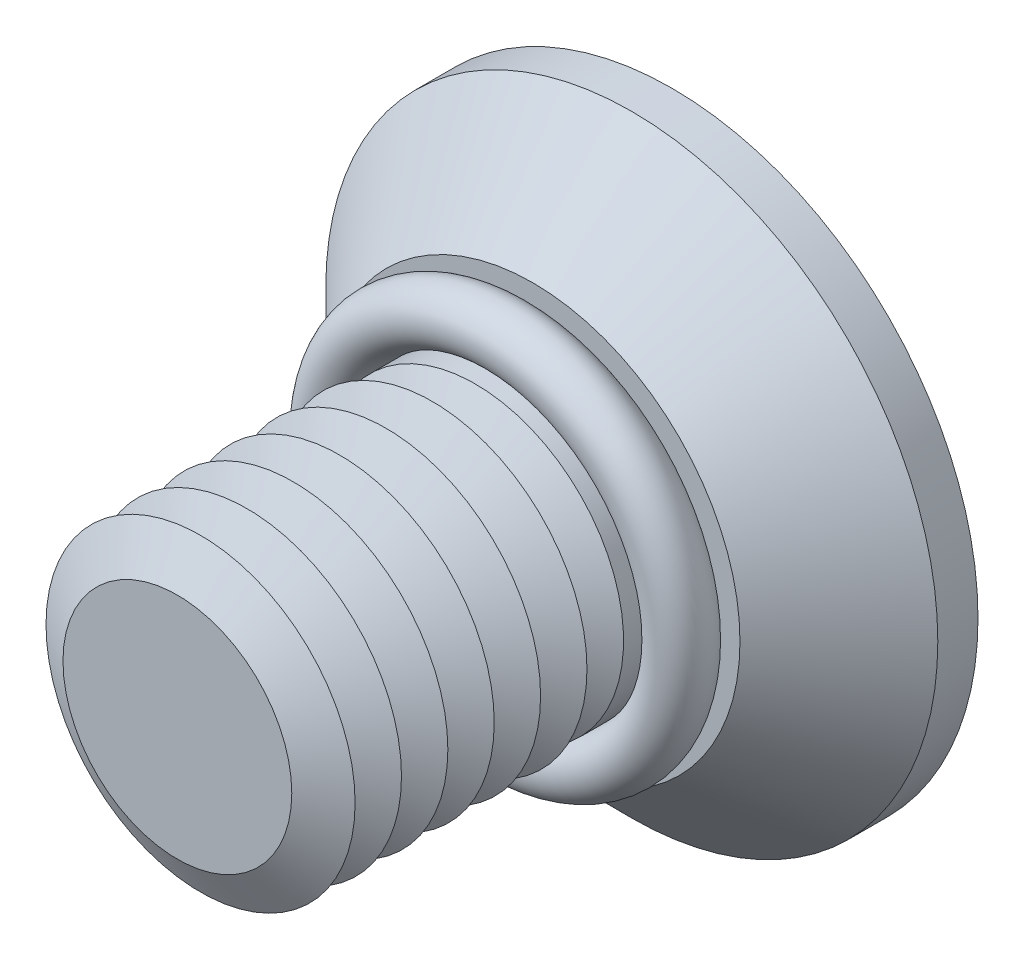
ISO-10303-21;
HEADER;
FILE_DESCRIPTION(('STEP AP214'),'2;1');
FILE_NAME('part.step','',(''),(''),'','','');
FILE_SCHEMA(('AUTOMOTIVE_DESIGN { 1 0 10303 214 1 1 1 1 }'));
ENDSEC;
DATA;
#1=APPLICATION_CONTEXT('core data for automotive mechanical design processes');
#2=APPLICATION_PROTOCOL_DEFINITION('international standard','automotive_design',2000,#1);
#3=PRODUCT_CONTEXT('',#1,'mechanical');
#4=PRODUCT('Part','Part','',(#3));
#5=PRODUCT_RELATED_PRODUCT_CATEGORY('part','',(#4));
#6=PRODUCT_DEFINITION_FORMATION('','',#4);
#7=PRODUCT_DEFINITION_CONTEXT('part definition',#1,'design');
#8=PRODUCT_DEFINITION('design','',#6,#7);
#9=PRODUCT_DEFINITION_SHAPE('','',#8);
#10=(LENGTH_UNIT() NAMED_UNIT(*) SI_UNIT(.MILLI.,.METRE.));
#11=(NAMED_UNIT(*) PLANE_ANGLE_UNIT() SI_UNIT($,.RADIAN.));
#12=(NAMED_UNIT(*) SI_UNIT($,.STERADIAN.) SOLID_ANGLE_UNIT());
#13=UNCERTAINTY_MEASURE_WITH_UNIT(LENGTH_MEASURE(1.E-05),#10,'distance_accuracy_value','');
#14=(GEOMETRIC_REPRESENTATION_CONTEXT(3) GLOBAL_UNCERTAINTY_ASSIGNED_CONTEXT((#13)) GLOBAL_UNIT_ASSIGNED_CONTEXT((#10,
#11,#12)) REPRESENTATION_CONTEXT('',''));
#15=CARTESIAN_POINT('',(0.,0.,0.));
#16=DIRECTION('',(0.,0.,1.));
#17=DIRECTION('',(1.,0.,0.));
#18=AXIS2_PLACEMENT_3D('',#15,#16,#17);
#19=CARTESIAN_POINT('',(0.,0.,5.39999999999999));
#20=DIRECTION('',(0.,0.,1.));
#21=DIRECTION('',(1.,0.,0.));
#22=AXIS2_PLACEMENT_3D('',#19,#20,#21);
#23=TOROIDAL_SURFACE('',#22,5.7,0.9);
#24=CARTESIAN_POINT('',(0.,5.7,5.39999999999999));
#25=DIRECTION('',(1.,0.,0.));
#26=DIRECTION('',(0.,0.,-1.));
#27=AXIS2_PLACEMENT_3D('',#24,#25,#26);
#28=CIRCLE('',#27,0.9);
#29=CARTESIAN_POINT('',(0.,6.6,5.39999999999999));
#30=VERTEX_POINT('',#29);
#31=EDGE_CURVE('P0_E10',#30,#30,#28,.T.);
#32=CARTESIAN_POINT('',(0.,0.,5.39999999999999));
#33=DIRECTION('',(0.,0.,1.));
#34=DIRECTION('',(1.,0.,0.));
#35=AXIS2_PLACEMENT_3D('',#32,#33,#34);
#36=CIRCLE('',#35,6.6);
#37=EDGE_CURVE('',#30,#30,#36,.T.);
#38=ORIENTED_EDGE('',*,*,#31,.F.);
#39=ORIENTED_EDGE('',*,*,#31,.T.);
#40=ORIENTED_EDGE('',*,*,#37,.T.);
#41=ORIENTED_EDGE('',*,*,#37,.F.);
#42=EDGE_LOOP('',(#38,#40,#39,#41));
#43=FACE_BOUND('',#42,.T.);
#44=ADVANCED_FACE('P0_F14',(#43),#23,.T.);
#45=CLOSED_SHELL('',(#44));
#46=MANIFOLD_SOLID_BREP('P0_B1',#45);
#47=CARTESIAN_POINT('',(0.,0.,8.5));
#48=DIRECTION('',(0.,0.,-1.));
#49=DIRECTION('',(-1.,0.,0.));
#50=AXIS2_PLACEMENT_3D('',#47,#48,#49);
#51=CONICAL_SURFACE('',#50,3.70096189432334,1.0471975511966);
#52=CARTESIAN_POINT('',(0.,0.,7.75));
#53=DIRECTION('',(0.,0.,1.));
#54=DIRECTION('',(1.,0.,0.));
#55=AXIS2_PLACEMENT_3D('',#52,#53,#54);
#56=CIRCLE('',#55,5.);
#57=CARTESIAN_POINT('',(5.,0.,7.75));
#58=VERTEX_POINT('',#57);
#59=EDGE_CURVE('P1_E324',#58,#58,#56,.T.);
#60=ORIENTED_EDGE('',*,*,#59,.T.);
#61=EDGE_LOOP('',(#60));
#62=FACE_BOUND('',#61,.T.);
#63=CARTESIAN_POINT('',(0.,0.,8.5));
#64=DIRECTION('',(0.,0.,1.));
#65=DIRECTION('',(1.,0.,0.));
#66=AXIS2_PLACEMENT_3D('',#63,#64,#65);
#67=CIRCLE('',#66,3.70096189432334);
#68=CARTESIAN_POINT('',(3.70096189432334,0.,8.5));
#69=VERTEX_POINT('',#68);
#70=EDGE_CURVE('P1_E321',#69,#69,#67,.T.);
#71=ORIENTED_EDGE('',*,*,#70,.F.);
#72=EDGE_LOOP('',(#71));
#73=FACE_BOUND('',#72,.T.);
#74=ADVANCED_FACE('P1_F15',(#62,#73),#51,.T.);
#75=CARTESIAN_POINT('',(0.,0.,9.25));
#76=DIRECTION('',(0.,0.,1.));
#77=DIRECTION('',(1.,0.,0.));
#78=AXIS2_PLACEMENT_3D('',#75,#76,#77);
#79=CONICAL_SURFACE('',#78,5.,1.0471975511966);
#80=ORIENTED_EDGE('',*,*,#70,.T.);
#81=EDGE_LOOP('',(#80));
#82=FACE_BOUND('',#81,.T.);
#83=CARTESIAN_POINT('',(0.,0.,9.25));
#84=DIRECTION('',(0.,0.,1.));
#85=DIRECTION('',(1.,0.,0.));
#86=AXIS2_PLACEMENT_3D('',#83,#84,#85);
#87=CIRCLE('',#86,5.);
#88=CARTESIAN_POINT('',(5.,0.,9.25));
#89=VERTEX_POINT('',#88);
#90=EDGE_CURVE('P1_E318',#89,#89,#87,.T.);
#91=ORIENTED_EDGE('',*,*,#90,.F.);
#92=EDGE_LOOP('',(#91));
#93=FACE_BOUND('',#92,.T.);
#94=ADVANCED_FACE('P1_F245',(#82,#93),#79,.T.);
#95=CARTESIAN_POINT('',(0.,0.,16.));
#96=DIRECTION('',(0.,0.,1.));
#97=DIRECTION('',(1.,0.,0.));
#98=AXIS2_PLACEMENT_3D('',#95,#96,#97);
#99=PLANE('',#98);
#100=CARTESIAN_POINT('',(0.,0.,16.));
#101=DIRECTION('',(0.,0.,1.));
#102=DIRECTION('',(1.,0.,0.));
#103=AXIS2_PLACEMENT_3D('',#100,#101,#102);
#104=CIRCLE('',#103,3.70096189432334);
#105=CARTESIAN_POINT('',(3.70096189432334,0.,16.));
#106=VERTEX_POINT('',#105);
#107=EDGE_CURVE('P1_E131',#106,#106,#104,.T.);
#108=ORIENTED_EDGE('',*,*,#107,.T.);
#109=EDGE_LOOP('',(#108));
#110=FACE_BOUND('',#109,.T.);
#111=ADVANCED_FACE('P1_F251',(#110),#99,.T.);
#112=CARTESIAN_POINT('',(0.,0.,16.));
#113=DIRECTION('',(0.,0.,-1.));
#114=DIRECTION('',(-1.,0.,0.));
#115=AXIS2_PLACEMENT_3D('',#112,#113,#114);
#116=CONICAL_SURFACE('',#115,3.70096189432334,1.0471975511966);
#117=CARTESIAN_POINT('',(0.,0.,15.25));
#118=DIRECTION('',(0.,0.,1.));
#119=DIRECTION('',(1.,0.,0.));
#120=AXIS2_PLACEMENT_3D('',#117,#118,#119);
#121=CIRCLE('',#120,5.);
#122=CARTESIAN_POINT('',(5.,0.,15.25));
#123=VERTEX_POINT('',#122);
#124=EDGE_CURVE('P1_E133',#123,#123,#121,.T.);
#125=ORIENTED_EDGE('',*,*,#124,.T.);
#126=EDGE_LOOP('',(#125));
#127=FACE_BOUND('',#126,.T.);
#128=ORIENTED_EDGE('',*,*,#107,.F.);
#129=EDGE_LOOP('',(#128));
#130=FACE_BOUND('',#129,.T.);
#131=ADVANCED_FACE('P1_F196',(#127,#130),#116,.T.);
#132=CARTESIAN_POINT('',(0.,0.,15.25));
#133=DIRECTION('',(0.,0.,1.));
#134=DIRECTION('',(1.,0.,0.));
#135=AXIS2_PLACEMENT_3D('',#132,#133,#134);
#136=CONICAL_SURFACE('',#135,5.,1.0471975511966);
#137=CARTESIAN_POINT('',(0.,0.,14.5));
#138=DIRECTION('',(0.,0.,1.));
#139=DIRECTION('',(1.,0.,0.));
#140=AXIS2_PLACEMENT_3D('',#137,#138,#139);
#141=CIRCLE('',#140,3.70096189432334);
#142=CARTESIAN_POINT('',(3.70096189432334,0.,14.5));
#143=VERTEX_POINT('',#142);
#144=EDGE_CURVE('P1_E297',#143,#143,#141,.T.);
#145=ORIENTED_EDGE('',*,*,#144,.T.);
#146=EDGE_LOOP('',(#145));
#147=FACE_BOUND('',#146,.T.);
#148=ORIENTED_EDGE('',*,*,#124,.F.);
#149=EDGE_LOOP('',(#148));
#150=FACE_BOUND('',#149,.T.);
#151=ADVANCED_FACE('P1_F284',(#147,#150),#136,.T.);
#152=CARTESIAN_POINT('',(0.,0.,14.5));
#153=DIRECTION('',(0.,0.,-1.));
#154=DIRECTION('',(-1.,0.,0.));
#155=AXIS2_PLACEMENT_3D('',#152,#153,#154);
#156=CONICAL_SURFACE('',#155,3.70096189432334,1.0471975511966);
#157=CARTESIAN_POINT('',(0.,0.,13.75));
#158=DIRECTION('',(0.,0.,1.));
#159=DIRECTION('',(1.,0.,0.));
#160=AXIS2_PLACEMENT_3D('',#157,#158,#159);
#161=CIRCLE('',#160,5.);
#162=CARTESIAN_POINT('',(5.,0.,13.75));
#163=VERTEX_POINT('',#162);
#164=EDGE_CURVE('P1_E294',#163,#163,#161,.T.);
#165=ORIENTED_EDGE('',*,*,#164,.T.);
#166=EDGE_LOOP('',(#165));
#167=FACE_BOUND('',#166,.T.);
#168=ORIENTED_EDGE('',*,*,#144,.F.);
#169=EDGE_LOOP('',(#168));
#170=FACE_BOUND('',#169,.T.);
#171=ADVANCED_FACE('P1_F279',(#167,#170),#156,.T.);
#172=CARTESIAN_POINT('',(0.,0.,13.75));
#173=DIRECTION('',(0.,0.,1.));
#174=DIRECTION('',(1.,0.,0.));
#175=AXIS2_PLACEMENT_3D('',#172,#173,#174);
#176=CONICAL_SURFACE('',#175,5.,1.0471975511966);
#177=CARTESIAN_POINT('',(0.,0.,13.));
#178=DIRECTION('',(0.,0.,1.));
#179=DIRECTION('',(1.,0.,0.));
#180=AXIS2_PLACEMENT_3D('',#177,#178,#179);
#181=CIRCLE('',#180,3.70096189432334);
#182=CARTESIAN_POINT('',(3.70096189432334,0.,13.));
#183=VERTEX_POINT('',#182);
#184=EDGE_CURVE('P1_E301',#183,#183,#181,.T.);
#185=ORIENTED_EDGE('',*,*,#184,.T.);
#186=EDGE_LOOP('',(#185));
#187=FACE_BOUND('',#186,.T.);
#188=ORIENTED_EDGE('',*,*,#164,.F.);
#189=EDGE_LOOP('',(#188));
#190=FACE_BOUND('',#189,.T.);
#191=ADVANCED_FACE('P1_F276',(#187,#190),#176,.T.);
#192=CARTESIAN_POINT('',(0.,0.,13.));
#193=DIRECTION('',(0.,0.,-1.));
#194=DIRECTION('',(-1.,0.,0.));
#195=AXIS2_PLACEMENT_3D('',#192,#193,#194);
#196=CONICAL_SURFACE('',#195,3.70096189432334,1.0471975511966);
#197=CARTESIAN_POINT('',(0.,0.,12.25));
#198=DIRECTION('',(0.,0.,1.));
#199=DIRECTION('',(1.,0.,0.));
#200=AXIS2_PLACEMENT_3D('',#197,#198,#199);
#201=CIRCLE('',#200,5.);
#202=CARTESIAN_POINT('',(5.,0.,12.25));
#203=VERTEX_POINT('',#202);
#204=EDGE_CURVE('P1_E306',#203,#203,#201,.T.);
#205=ORIENTED_EDGE('',*,*,#204,.T.);
#206=EDGE_LOOP('',(#205));
#207=FACE_BOUND('',#206,.T.);
#208=ORIENTED_EDGE('',*,*,#184,.F.);
#209=EDGE_LOOP('',(#208));
#210=FACE_BOUND('',#209,.T.);
#211=ADVANCED_FACE('P1_F271',(#207,#210),#196,.T.);
#212=CARTESIAN_POINT('',(0.,0.,12.25));
#213=DIRECTION('',(0.,0.,1.));
#214=DIRECTION('',(1.,0.,0.));
#215=AXIS2_PLACEMENT_3D('',#212,#213,#214);
#216=CONICAL_SURFACE('',#215,5.,1.0471975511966);
#217=CARTESIAN_POINT('',(0.,0.,11.5));
#218=DIRECTION('',(0.,0.,1.));
#219=DIRECTION('',(1.,0.,0.));
#220=AXIS2_PLACEMENT_3D('',#217,#218,#219);
#221=CIRCLE('',#220,3.70096189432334);
#222=CARTESIAN_POINT('',(3.70096189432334,0.,11.5));
#223=VERTEX_POINT('',#222);
#224=EDGE_CURVE('P1_E309',#223,#223,#221,.T.);
#225=ORIENTED_EDGE('',*,*,#224,.T.);
#226=EDGE_LOOP('',(#225));
#227=FACE_BOUND('',#226,.T.);
#228=ORIENTED_EDGE('',*,*,#204,.F.);
#229=EDGE_LOOP('',(#228));
#230=FACE_BOUND('',#229,.T.);
#231=ADVANCED_FACE('P1_F268',(#227,#230),#216,.T.);
#232=CARTESIAN_POINT('',(0.,0.,11.5));
#233=DIRECTION('',(0.,0.,-1.));
#234=DIRECTION('',(-1.,0.,0.));
#235=AXIS2_PLACEMENT_3D('',#232,#233,#234);
#236=CONICAL_SURFACE('',#235,3.70096189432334,1.0471975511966);
#237=CARTESIAN_POINT('',(0.,0.,10.75));
#238=DIRECTION('',(0.,0.,1.));
#239=DIRECTION('',(1.,0.,0.));
#240=AXIS2_PLACEMENT_3D('',#237,#238,#239);
#241=CIRCLE('',#240,5.);
#242=CARTESIAN_POINT('',(5.,0.,10.75));
#243=VERTEX_POINT('',#242);
#244=EDGE_CURVE('P1_E312',#243,#243,#241,.T.);
#245=ORIENTED_EDGE('',*,*,#244,.T.);
#246=EDGE_LOOP('',(#245));
#247=FACE_BOUND('',#246,.T.);
#248=ORIENTED_EDGE('',*,*,#224,.F.);
#249=EDGE_LOOP('',(#248));
#250=FACE_BOUND('',#249,.T.);
#251=ADVANCED_FACE('P1_F262',(#247,#250),#236,.T.);
#252=CARTESIAN_POINT('',(0.,0.,10.75));
#253=DIRECTION('',(0.,0.,1.));
#254=DIRECTION('',(1.,0.,0.));
#255=AXIS2_PLACEMENT_3D('',#252,#253,#254);
#256=CONICAL_SURFACE('',#255,5.,1.0471975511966);
#257=CARTESIAN_POINT('',(0.,0.,10.));
#258=DIRECTION('',(0.,0.,1.));
#259=DIRECTION('',(1.,0.,0.));
#260=AXIS2_PLACEMENT_3D('',#257,#258,#259);
#261=CIRCLE('',#260,3.70096189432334);
#262=CARTESIAN_POINT('',(3.70096189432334,0.,10.));
#263=VERTEX_POINT('',#262);
#264=EDGE_CURVE('P1_E315',#263,#263,#261,.T.);
#265=ORIENTED_EDGE('',*,*,#264,.T.);
#266=EDGE_LOOP('',(#265));
#267=FACE_BOUND('',#266,.T.);
#268=ORIENTED_EDGE('',*,*,#244,.F.);
#269=EDGE_LOOP('',(#268));
#270=FACE_BOUND('',#269,.T.);
#271=ADVANCED_FACE('P1_F258',(#267,#270),#256,.T.);
#272=CARTESIAN_POINT('',(0.,0.,10.));
#273=DIRECTION('',(0.,0.,-1.));
#274=DIRECTION('',(-1.,0.,0.));
#275=AXIS2_PLACEMENT_3D('',#272,#273,#274);
#276=CONICAL_SURFACE('',#275,3.70096189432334,1.0471975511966);
#277=ORIENTED_EDGE('',*,*,#90,.T.);
#278=EDGE_LOOP('',(#277));
#279=FACE_BOUND('',#278,.T.);
#280=ORIENTED_EDGE('',*,*,#264,.F.);
#281=EDGE_LOOP('',(#280));
#282=FACE_BOUND('',#281,.T.);
#283=ADVANCED_FACE('P1_F261',(#279,#282),#276,.T.);
#284=CARTESIAN_POINT('',(0.,0.,7.));
#285=DIRECTION('',(0.,0.,-1.));
#286=DIRECTION('',(-1.,0.,0.));
#287=AXIS2_PLACEMENT_3D('',#284,#285,#286);
#288=CONICAL_SURFACE('',#287,3.70096189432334,1.0471975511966);
#289=CARTESIAN_POINT('',(0.,0.,7.));
#290=DIRECTION('',(0.,0.,1.));
#291=DIRECTION('',(1.,0.,0.));
#292=AXIS2_PLACEMENT_3D('',#289,#290,#291);
#293=CIRCLE('',#292,3.70096189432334);
#294=CARTESIAN_POINT('',(3.70096189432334,0.,7.));
#295=VERTEX_POINT('',#294);
#296=EDGE_CURVE('P1_E326',#295,#295,#293,.T.);
#297=ORIENTED_EDGE('',*,*,#296,.F.);
#298=EDGE_LOOP('',(#297));
#299=FACE_BOUND('',#298,.T.);
#300=CARTESIAN_POINT('',(0.,0.,6.36547005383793));
#301=DIRECTION('',(0.,0.,-1.));
#302=DIRECTION('',(-1.,0.,0.));
#303=AXIS2_PLACEMENT_3D('',#300,#301,#302);
#304=CIRCLE('',#303,4.8);
#305=CARTESIAN_POINT('',(-4.8,0.,6.36547005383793));
#306=VERTEX_POINT('',#305);
#307=EDGE_CURVE('P1_E19',#306,#306,#304,.F.);
#308=ORIENTED_EDGE('',*,*,#307,.T.);
#309=EDGE_LOOP('',(#308));
#310=FACE_BOUND('',#309,.T.);
#311=ADVANCED_FACE('P1_F266',(#299,#310),#288,.T.);
#312=CARTESIAN_POINT('',(0.,0.,7.75));
#313=DIRECTION('',(0.,0.,1.));
#314=DIRECTION('',(1.,0.,0.));
#315=AXIS2_PLACEMENT_3D('',#312,#313,#314);
#316=CONICAL_SURFACE('',#315,5.,1.0471975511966);
#317=ORIENTED_EDGE('',*,*,#296,.T.);
#318=EDGE_LOOP('',(#317));
#319=FACE_BOUND('',#318,.T.);
#320=ORIENTED_EDGE('',*,*,#59,.F.);
#321=EDGE_LOOP('',(#320));
#322=FACE_BOUND('',#321,.T.);
#323=ADVANCED_FACE('P1_F330',(#319,#322),#316,.T.);
#324=CARTESIAN_POINT('',(0.,0.,4.));
#325=DIRECTION('',(0.,0.,-1.));
#326=DIRECTION('',(-1.,0.,0.));
#327=AXIS2_PLACEMENT_3D('',#324,#325,#326);
#328=CONICAL_SURFACE('',#327,3.,1.0471975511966);
#329=CARTESIAN_POINT('',(0.,0.,5.73205080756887));
#330=VERTEX_POINT('',#329);
#331=VERTEX_LOOP('',#330);
#332=FACE_BOUND('',#331,.T.);
#333=CARTESIAN_POINT('',(0.,0.,4.));
#334=DIRECTION('',(0.,0.,-1.));
#335=DIRECTION('',(-1.,0.,0.));
#336=AXIS2_PLACEMENT_3D('',#333,#334,#335);
#337=CIRCLE('',#336,3.);
#338=CARTESIAN_POINT('',(-3.,0.,4.));
#339=VERTEX_POINT('',#338);
#340=CARTESIAN_POINT('',(-1.5,2.59807621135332,4.));
#341=VERTEX_POINT('',#340);
#342=EDGE_CURVE('P1_E117',#339,#341,#337,.T.);
#343=ORIENTED_EDGE('',*,*,#342,.T.);
#344=CARTESIAN_POINT('',(0.,0.,4.));
#345=DIRECTION('',(0.,0.,-1.));
#346=DIRECTION('',(-1.,0.,0.));
#347=AXIS2_PLACEMENT_3D('',#344,#345,#346);
#348=CIRCLE('',#347,3.);
#349=CARTESIAN_POINT('',(1.5,2.59807621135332,4.));
#350=VERTEX_POINT('',#349);
#351=EDGE_CURVE('P1_E24',#341,#350,#348,.T.);
#352=ORIENTED_EDGE('',*,*,#351,.T.);
#353=CARTESIAN_POINT('',(3.,0.,4.));
#354=VERTEX_POINT('',#353);
#355=EDGE_CURVE('P1_E635',#350,#354,#348,.T.);
#356=ORIENTED_EDGE('',*,*,#355,.T.);
#357=CARTESIAN_POINT('',(1.5,-2.59807621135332,4.));
#358=VERTEX_POINT('',#357);
#359=EDGE_CURVE('P1_E628',#354,#358,#348,.T.);
#360=ORIENTED_EDGE('',*,*,#359,.T.);
#361=CARTESIAN_POINT('',(-1.5,-2.59807621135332,4.));
#362=VERTEX_POINT('',#361);
#363=EDGE_CURVE('P1_E182',#358,#362,#348,.T.);
#364=ORIENTED_EDGE('',*,*,#363,.T.);
#365=EDGE_CURVE('P1_E179',#362,#339,#348,.T.);
#366=ORIENTED_EDGE('',*,*,#365,.T.);
#367=EDGE_LOOP('',(#343,#352,#356,#360,#364,#366));
#368=FACE_BOUND('',#367,.T.);
#369=ADVANCED_FACE('P1_F198',(#332,#368),#328,.F.);
#370=CARTESIAN_POINT('',(0.,0.,4.));
#371=DIRECTION('',(0.,0.,-1.));
#372=DIRECTION('',(-1.,0.,0.));
#373=AXIS2_PLACEMENT_3D('',#370,#371,#372);
#374=PLANE('',#373);
#375=ORIENTED_EDGE('',*,*,#363,.F.);
#376=DIRECTION('',(-0.866025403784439,-0.5,0.));
#377=VECTOR('',#376,1.);
#378=CARTESIAN_POINT('',(3.,-1.73205080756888,4.));
#379=LINE('',#378,#377);
#380=CARTESIAN_POINT('',(0.,-3.46410161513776,4.));
#381=VERTEX_POINT('',#380);
#382=EDGE_CURVE('P1_E644',#358,#381,#379,.T.);
#383=ORIENTED_EDGE('',*,*,#382,.T.);
#384=DIRECTION('',(-0.866025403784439,0.5,0.));
#385=VECTOR('',#384,1.);
#386=CARTESIAN_POINT('',(0.,-3.46410161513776,4.));
#387=LINE('',#386,#385);
#388=EDGE_CURVE('P1_E651',#381,#362,#387,.T.);
#389=ORIENTED_EDGE('',*,*,#388,.T.);
#390=EDGE_LOOP('',(#375,#383,#389));
#391=FACE_BOUND('',#390,.T.);
#392=ADVANCED_FACE('P1_F444',(#391),#374,.T.);
#393=ORIENTED_EDGE('',*,*,#365,.F.);
#394=CARTESIAN_POINT('',(-3.,-1.73205080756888,4.));
#395=VERTEX_POINT('',#394);
#396=EDGE_CURVE('P1_E654',#362,#395,#387,.T.);
#397=ORIENTED_EDGE('',*,*,#396,.T.);
#398=DIRECTION('',(0.,1.,0.));
#399=VECTOR('',#398,1.);
#400=CARTESIAN_POINT('',(-3.,-1.73205080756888,4.));
#401=LINE('',#400,#399);
#402=EDGE_CURVE('P1_E123',#395,#339,#401,.T.);
#403=ORIENTED_EDGE('',*,*,#402,.T.);
#404=EDGE_LOOP('',(#393,#397,#403));
#405=FACE_BOUND('',#404,.T.);
#406=ADVANCED_FACE('P1_F231',(#405),#374,.T.);
#407=ORIENTED_EDGE('',*,*,#342,.F.);
#408=CARTESIAN_POINT('',(-3.,1.73205080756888,4.));
#409=VERTEX_POINT('',#408);
#410=EDGE_CURVE('P1_E656',#339,#409,#401,.T.);
#411=ORIENTED_EDGE('',*,*,#410,.T.);
#412=DIRECTION('',(0.866025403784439,0.5,0.));
#413=VECTOR('',#412,1.);
#414=CARTESIAN_POINT('',(-3.,1.73205080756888,4.));
#415=LINE('',#414,#413);
#416=EDGE_CURVE('P1_E659',#409,#341,#415,.T.);
#417=ORIENTED_EDGE('',*,*,#416,.T.);
#418=EDGE_LOOP('',(#407,#411,#417));
#419=FACE_BOUND('',#418,.T.);
#420=ADVANCED_FACE('P1_F463',(#419),#374,.T.);
#421=ORIENTED_EDGE('',*,*,#351,.F.);
#422=CARTESIAN_POINT('',(0.,3.46410161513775,4.));
#423=VERTEX_POINT('',#422);
#424=EDGE_CURVE('P1_E658',#341,#423,#415,.T.);
#425=ORIENTED_EDGE('',*,*,#424,.T.);
#426=DIRECTION('',(0.866025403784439,-0.5,0.));
#427=VECTOR('',#426,1.);
#428=CARTESIAN_POINT('',(0.,3.46410161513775,4.));
#429=LINE('',#428,#427);
#430=EDGE_CURVE('P1_E161',#423,#350,#429,.T.);
#431=ORIENTED_EDGE('',*,*,#430,.T.);
#432=EDGE_LOOP('',(#421,#425,#431));
#433=FACE_BOUND('',#432,.T.);
#434=ADVANCED_FACE('P1_F472',(#433),#374,.T.);
#435=ORIENTED_EDGE('',*,*,#355,.F.);
#436=CARTESIAN_POINT('',(3.,1.73205080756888,4.));
#437=VERTEX_POINT('',#436);
#438=EDGE_CURVE('P1_E643',#350,#437,#429,.T.);
#439=ORIENTED_EDGE('',*,*,#438,.T.);
#440=DIRECTION('',(0.,-1.,0.));
#441=VECTOR('',#440,1.);
#442=CARTESIAN_POINT('',(3.,1.73205080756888,4.));
#443=LINE('',#442,#441);
#444=EDGE_CURVE('P1_E638',#437,#354,#443,.T.);
#445=ORIENTED_EDGE('',*,*,#444,.T.);
#446=EDGE_LOOP('',(#435,#439,#445));
#447=FACE_BOUND('',#446,.T.);
#448=ADVANCED_FACE('P1_F481',(#447),#374,.T.);
#449=ORIENTED_EDGE('',*,*,#359,.F.);
#450=CARTESIAN_POINT('',(3.,-1.73205080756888,4.));
#451=VERTEX_POINT('',#450);
#452=EDGE_CURVE('P1_E630',#354,#451,#443,.T.);
#453=ORIENTED_EDGE('',*,*,#452,.T.);
#454=EDGE_CURVE('P1_E125',#451,#358,#379,.T.);
#455=ORIENTED_EDGE('',*,*,#454,.T.);
#456=EDGE_LOOP('',(#449,#453,#455));
#457=FACE_BOUND('',#456,.T.);
#458=ADVANCED_FACE('P1_F229',(#457),#374,.T.);
#459=CARTESIAN_POINT('',(3.,-1.73205080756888,4.));
#460=DIRECTION('',(0.5,-0.866025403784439,0.));
#461=DIRECTION('',(0.866025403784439,0.5,0.));
#462=AXIS2_PLACEMENT_3D('',#459,#460,#461);
#463=PLANE('',#462);
#464=DIRECTION('',(0.,0.,-1.));
#465=VECTOR('',#464,1.);
#466=CARTESIAN_POINT('',(3.,-1.73205080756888,4.));
#467=LINE('',#466,#465);
#468=CARTESIAN_POINT('',(3.,-1.73205080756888,0.));
#469=VERTEX_POINT('',#468);
#470=EDGE_CURVE('P1_E164',#451,#469,#467,.T.);
#471=ORIENTED_EDGE('',*,*,#470,.T.);
#472=CARTESIAN_POINT('',(3.0002,-1.73193533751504,-3.09416546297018E-05));
#473=CARTESIAN_POINT('',(2.8756009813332,-1.80387261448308,0.0192538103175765));
#474=CARTESIAN_POINT('',(2.75077603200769,-1.87594033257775,0.0367612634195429));
#475=CARTESIAN_POINT('',(2.50068525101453,-2.02033031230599,0.0675203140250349));
#476=CARTESIAN_POINT('',(2.37541926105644,-2.0926526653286,0.08077018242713));
#477=CARTESIAN_POINT('',(2.12520598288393,-2.23711336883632,0.102240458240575));
#478=CARTESIAN_POINT('',(2.00026038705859,-2.30925074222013,0.110486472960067));
#479=CARTESIAN_POINT('',(1.75020983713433,-2.45361749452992,0.12154354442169));
#480=CARTESIAN_POINT('',(1.62510491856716,-2.52584685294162,0.124355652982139));
#481=CARTESIAN_POINT('',(1.37489508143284,-2.67030556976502,0.124355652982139));
#482=CARTESIAN_POINT('',(1.24979016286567,-2.74253492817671,0.12154354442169));
#483=CARTESIAN_POINT('',(0.99973961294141,-2.8869016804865,0.110486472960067));
#484=CARTESIAN_POINT('',(0.874794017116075,-2.95903905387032,0.102240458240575));
#485=CARTESIAN_POINT('',(0.624580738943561,-3.10349975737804,0.0807701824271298));
#486=CARTESIAN_POINT('',(0.499314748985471,-3.17582211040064,0.0675203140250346));
#487=CARTESIAN_POINT('',(0.24922396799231,-3.32021209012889,0.0367612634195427));
#488=CARTESIAN_POINT('',(0.124399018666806,-3.39227980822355,0.0192538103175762));
#489=CARTESIAN_POINT('',(-0.000199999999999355,-3.46421708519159,-3.09416546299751E-05));
#490=B_SPLINE_CURVE_WITH_KNOTS('',3,(#472,#473,#474,#475,#476,#477,#478,#479,#480,#481,#482,
#483,#484,#485,#486,#487,#488,#489),.UNSPECIFIED.,.F.,.F.,(4,2,2,2,2,2,2,2,4),(0.,
0.435506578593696,0.87118980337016,1.3046241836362,1.73797465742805,2.17132513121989,
2.60475951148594,3.0404427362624,3.4759493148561),.UNSPECIFIED.);
#491=CARTESIAN_POINT('',(0.,-3.46410161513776,0.));
#492=VERTEX_POINT('',#491);
#493=EDGE_CURVE('P1_E118',#469,#492,#490,.T.);
#494=ORIENTED_EDGE('',*,*,#493,.T.);
#495=DIRECTION('',(0.,0.,-1.));
#496=VECTOR('',#495,1.);
#497=CARTESIAN_POINT('',(0.,-3.46410161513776,4.));
#498=LINE('',#497,#496);
#499=EDGE_CURVE('P1_E116',#381,#492,#498,.T.);
#500=ORIENTED_EDGE('',*,*,#499,.F.);
#501=ORIENTED_EDGE('',*,*,#382,.F.);
#502=ORIENTED_EDGE('',*,*,#454,.F.);
#503=EDGE_LOOP('',(#471,#494,#500,#501,#502));
#504=FACE_BOUND('',#503,.T.);
#505=ADVANCED_FACE('P1_F226',(#504),#463,.F.);
#506=CARTESIAN_POINT('',(0.,-3.46410161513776,4.));
#507=DIRECTION('',(-0.5,-0.866025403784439,0.));
#508=DIRECTION('',(0.866025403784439,-0.5,0.));
#509=AXIS2_PLACEMENT_3D('',#506,#507,#508);
#510=PLANE('',#509);
#511=ORIENTED_EDGE('',*,*,#499,.T.);
#512=CARTESIAN_POINT('',(0.000200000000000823,-3.46421708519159,-3.09416546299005E-05));
#513=CARTESIAN_POINT('',(-0.124399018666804,-3.39227980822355,0.0192538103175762));
#514=CARTESIAN_POINT('',(-0.249223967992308,-3.32021209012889,0.0367612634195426));
#515=CARTESIAN_POINT('',(-0.49931474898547,-3.17582211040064,0.0675203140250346));
#516=CARTESIAN_POINT('',(-0.62458073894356,-3.10349975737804,0.0807701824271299));
#517=CARTESIAN_POINT('',(-0.874794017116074,-2.95903905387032,0.102240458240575));
#518=CARTESIAN_POINT('',(-0.999739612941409,-2.8869016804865,0.110486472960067));
#519=CARTESIAN_POINT('',(-1.24979016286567,-2.74253492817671,0.12154354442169));
#520=CARTESIAN_POINT('',(-1.37489508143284,-2.67030556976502,0.124355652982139));
#521=CARTESIAN_POINT('',(-1.62510491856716,-2.52584685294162,0.124355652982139));
#522=CARTESIAN_POINT('',(-1.75020983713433,-2.45361749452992,0.12154354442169));
#523=CARTESIAN_POINT('',(-2.00026038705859,-2.30925074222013,0.110486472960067));
#524=CARTESIAN_POINT('',(-2.12520598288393,-2.23711336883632,0.102240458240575));
#525=CARTESIAN_POINT('',(-2.37541926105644,-2.0926526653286,0.0807701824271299));
#526=CARTESIAN_POINT('',(-2.50068525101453,-2.02033031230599,0.0675203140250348));
#527=CARTESIAN_POINT('',(-2.75077603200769,-1.87594033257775,0.0367612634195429));
#528=CARTESIAN_POINT('',(-2.87560098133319,-1.80387261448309,0.0192538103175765));
#529=CARTESIAN_POINT('',(-3.0002,-1.73193533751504,-3.09416546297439E-05));
#530=B_SPLINE_CURVE_WITH_KNOTS('',3,(#512,#513,#514,#515,#516,#517,#518,#519,#520,#521,#522,
#523,#524,#525,#526,#527,#528,#529),.UNSPECIFIED.,.F.,.F.,(4,2,2,2,2,2,2,2,4),(0.,
0.435506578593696,0.87118980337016,1.3046241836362,1.73797465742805,2.17132513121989,
2.60475951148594,3.0404427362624,3.4759493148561),.UNSPECIFIED.);
#531=CARTESIAN_POINT('',(-3.,-1.73205080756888,0.));
#532=VERTEX_POINT('',#531);
#533=EDGE_CURVE('P1_E94',#492,#532,#530,.T.);
#534=ORIENTED_EDGE('',*,*,#533,.T.);
#535=DIRECTION('',(0.,0.,-1.));
#536=VECTOR('',#535,1.);
#537=CARTESIAN_POINT('',(-3.,-1.73205080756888,4.));
#538=LINE('',#537,#536);
#539=EDGE_CURVE('P1_E112',#395,#532,#538,.T.);
#540=ORIENTED_EDGE('',*,*,#539,.F.);
#541=ORIENTED_EDGE('',*,*,#396,.F.);
#542=ORIENTED_EDGE('',*,*,#388,.F.);
#543=EDGE_LOOP('',(#511,#534,#540,#541,#542));
#544=FACE_BOUND('',#543,.T.);
#545=ADVANCED_FACE('P1_F110',(#544),#510,.F.);
#546=CARTESIAN_POINT('',(-3.,-1.73205080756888,4.));
#547=DIRECTION('',(-1.,0.,0.));
#548=DIRECTION('',(0.,0.,1.));
#549=AXIS2_PLACEMENT_3D('',#546,#547,#548);
#550=PLANE('',#549);
#551=ORIENTED_EDGE('',*,*,#539,.T.);
#552=CARTESIAN_POINT('',(-3.,-4.52161137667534,-0.525775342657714));
#553=CARTESIAN_POINT('',(-3.,-4.3861469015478,-0.495537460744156));
#554=CARTESIAN_POINT('',(-3.,-4.25059605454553,-0.465680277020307));
#555=CARTESIAN_POINT('',(-3.,-3.97927914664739,-0.406931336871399));
#556=CARTESIAN_POINT('',(-3.,-3.84351307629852,-0.378039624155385));
#557=CARTESIAN_POINT('',(-3.,-3.57159492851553,-0.321399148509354));
#558=CARTESIAN_POINT('',(-3.,-3.43544259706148,-0.293651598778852));
#559=CARTESIAN_POINT('',(-3.,-3.16285056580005,-0.239614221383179));
#560=CARTESIAN_POINT('',(-3.,-3.02641086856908,-0.213324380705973));
#561=CARTESIAN_POINT('',(-3.,-2.61896324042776,-0.137569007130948));
#562=CARTESIAN_POINT('',(-3.,-2.34745999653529,-0.0907136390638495));
#563=CARTESIAN_POINT('',(-3.,-1.8027975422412,-0.0077090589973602));
#564=CARTESIAN_POINT('',(-3.,-1.52963867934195,0.0284423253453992));
#565=CARTESIAN_POINT('',(-3.,-1.11712206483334,0.0711149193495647));
#566=CARTESIAN_POINT('',(-3.,-0.978367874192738,0.0834493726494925));
#567=CARTESIAN_POINT('',(-3.,-0.700531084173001,0.103508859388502));
#568=CARTESIAN_POINT('',(-3.,-0.561448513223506,0.11123427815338));
#569=CARTESIAN_POINT('',(-3.,-0.283146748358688,0.121626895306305));
#570=CARTESIAN_POINT('',(-3.,-0.143927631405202,0.124296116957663));
#571=CARTESIAN_POINT('',(-3.,0.134513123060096,0.124413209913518));
#572=CARTESIAN_POINT('',(-3.,0.273734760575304,0.121861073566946));
#573=CARTESIAN_POINT('',(-3.,0.552556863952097,0.111676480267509));
#574=CARTESIAN_POINT('',(-3.,0.692156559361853,0.104023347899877));
#575=CARTESIAN_POINT('',(-3.,0.971024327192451,0.0840648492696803));
#576=CARTESIAN_POINT('',(-3.,1.11029238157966,0.0717592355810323));
#577=CARTESIAN_POINT('',(-3.,1.3884939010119,0.0431025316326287));
#578=CARTESIAN_POINT('',(-3.,1.52742710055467,0.0267489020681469));
#579=CARTESIAN_POINT('',(-3.,1.80484805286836,-0.00934194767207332));
#580=CARTESIAN_POINT('',(-3.,1.94333580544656,-0.0290791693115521));
#581=CARTESIAN_POINT('',(-3.,2.2235029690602,-0.0718742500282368));
#582=CARTESIAN_POINT('',(-3.,2.36517107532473,-0.0950054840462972));
#583=CARTESIAN_POINT('',(-3.,2.648104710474,-0.143617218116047));
#584=CARTESIAN_POINT('',(-3.,2.78937022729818,-0.169097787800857));
#585=CARTESIAN_POINT('',(-3.,3.21267286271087,-0.248342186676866));
#586=CARTESIAN_POINT('',(-3.,3.49418463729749,-0.304903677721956));
#587=CARTESIAN_POINT('',(-3.,4.05626646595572,-0.422827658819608));
#588=CARTESIAN_POINT('',(-3.,4.33683622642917,-0.484191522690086));
#589=CARTESIAN_POINT('',(-3.,4.89726247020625,-0.610112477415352));
#590=CARTESIAN_POINT('',(-3.,5.17711893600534,-0.674669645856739));
#591=CARTESIAN_POINT('',(-3.,5.73290235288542,-0.805171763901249));
#592=CARTESIAN_POINT('',(-3.,6.00883557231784,-0.871090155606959));
#593=CARTESIAN_POINT('',(-3.,6.56033924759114,-1.00445136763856));
#594=CARTESIAN_POINT('',(-3.,6.83590969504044,-1.07189422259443));
#595=CARTESIAN_POINT('',(-3.,7.38639195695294,-1.20779575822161));
#596=CARTESIAN_POINT('',(-3.,7.66130415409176,-1.27625289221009));
#597=CARTESIAN_POINT('',(-3.,8.21090603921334,-1.41401333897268));
#598=CARTESIAN_POINT('',(-3.,8.48559573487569,-1.48331662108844));
#599=CARTESIAN_POINT('',(-3.,8.76020986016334,-1.55291480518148));
#600=B_SPLINE_CURVE_WITH_KNOTS('',3,(#552,#553,#554,#555,#556,#557,#558,#559,#560,#561,#562,
#563,#564,#565,#566,#567,#568,#569,#570,#571,#572,#573,#574,#575,#576,#577,#578,#579,#580,#581,
#582,#583,#584,#585,#586,#587,#588,#589,#590,#591,#592,#593,#594,#595,#596,#597,#598,#599),
.UNSPECIFIED.,.F.,.F.,(4,2,2,2,2,2,2,2,2,2,2,2,2,2,2,2,2,2,2,2,2,2,2,4),(0.,0.416396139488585,
0.832811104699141,1.24965681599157,1.66649880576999,2.49292514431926,3.31918364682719,
3.73702338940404,4.1548281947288,4.57246577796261,4.99010397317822,5.40944532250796,
5.82880897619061,6.24843636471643,6.66806393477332,7.09867155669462,7.52929194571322,
8.39062817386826,9.25221171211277,10.1138161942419,10.9649037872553,11.8160107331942,
12.6659315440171,13.5158216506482),.UNSPECIFIED.);
#601=CARTESIAN_POINT('',(-3.,1.73205080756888,0.));
#602=VERTEX_POINT('',#601);
#603=EDGE_CURVE('P1_E10',#532,#602,#600,.T.);
#604=ORIENTED_EDGE('',*,*,#603,.T.);
#605=DIRECTION('',(0.,0.,-1.));
#606=VECTOR('',#605,1.);
#607=CARTESIAN_POINT('',(-3.,1.73205080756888,4.));
#608=LINE('',#607,#606);
#609=EDGE_CURVE('P1_E124',#409,#602,#608,.T.);
#610=ORIENTED_EDGE('',*,*,#609,.F.);
#611=ORIENTED_EDGE('',*,*,#410,.F.);
#612=ORIENTED_EDGE('',*,*,#402,.F.);
#613=EDGE_LOOP('',(#551,#604,#610,#611,#612));
#614=FACE_BOUND('',#613,.T.);
#615=ADVANCED_FACE('P1_F120',(#614),#550,.F.);
#616=CARTESIAN_POINT('',(-3.,1.73205080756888,4.));
#617=DIRECTION('',(-0.5,0.866025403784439,0.));
#618=DIRECTION('',(-0.866025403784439,-0.5,0.));
#619=AXIS2_PLACEMENT_3D('',#616,#617,#618);
#620=PLANE('',#619);
#621=ORIENTED_EDGE('',*,*,#609,.T.);
#622=CARTESIAN_POINT('',(-3.0002,1.73193533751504,-3.09416546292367E-05));
#623=CARTESIAN_POINT('',(-2.87560098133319,1.80387261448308,0.019253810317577));
#624=CARTESIAN_POINT('',(-2.75077603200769,1.87594033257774,0.0367612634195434));
#625=CARTESIAN_POINT('',(-2.50068525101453,2.02033031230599,0.0675203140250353));
#626=CARTESIAN_POINT('',(-2.37541926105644,2.0926526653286,0.0807701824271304));
#627=CARTESIAN_POINT('',(-2.12520598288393,2.23711336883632,0.102240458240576));
#628=CARTESIAN_POINT('',(-2.00026038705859,2.30925074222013,0.110486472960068));
#629=CARTESIAN_POINT('',(-1.75020983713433,2.45361749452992,0.121543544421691));
#630=CARTESIAN_POINT('',(-1.62510491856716,2.52584685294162,0.12435565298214));
#631=CARTESIAN_POINT('',(-1.37489508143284,2.67030556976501,0.12435565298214));
#632=CARTESIAN_POINT('',(-1.24979016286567,2.74253492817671,0.121543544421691));
#633=CARTESIAN_POINT('',(-0.999739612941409,2.8869016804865,0.110486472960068));
#634=CARTESIAN_POINT('',(-0.874794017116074,2.95903905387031,0.102240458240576));
#635=CARTESIAN_POINT('',(-0.62458073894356,3.10349975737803,0.0807701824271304));
#636=CARTESIAN_POINT('',(-0.499314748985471,3.17582211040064,0.0675203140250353));
#637=CARTESIAN_POINT('',(-0.249223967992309,3.32021209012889,0.0367612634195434));
#638=CARTESIAN_POINT('',(-0.124399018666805,3.39227980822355,0.0192538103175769));
#639=CARTESIAN_POINT('',(0.000199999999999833,3.46421708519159,-3.09416546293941E-05));
#640=B_SPLINE_CURVE_WITH_KNOTS('',3,(#622,#623,#624,#625,#626,#627,#628,#629,#630,#631,#632,
#633,#634,#635,#636,#637,#638,#639),.UNSPECIFIED.,.F.,.F.,(4,2,2,2,2,2,2,2,4),(0.,
0.435506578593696,0.87118980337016,1.3046241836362,1.73797465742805,2.17132513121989,
2.60475951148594,3.0404427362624,3.4759493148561),.UNSPECIFIED.);
#641=CARTESIAN_POINT('',(0.,3.46410161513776,0.));
#642=VERTEX_POINT('',#641);
#643=EDGE_CURVE('P1_E136',#602,#642,#640,.T.);
#644=ORIENTED_EDGE('',*,*,#643,.T.);
#645=DIRECTION('',(0.,0.,-1.));
#646=VECTOR('',#645,1.);
#647=CARTESIAN_POINT('',(0.,3.46410161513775,4.));
#648=LINE('',#647,#646);
#649=EDGE_CURVE('P1_E155',#423,#642,#648,.T.);
#650=ORIENTED_EDGE('',*,*,#649,.F.);
#651=ORIENTED_EDGE('',*,*,#424,.F.);
#652=ORIENTED_EDGE('',*,*,#416,.F.);
#653=EDGE_LOOP('',(#621,#644,#650,#651,#652));
#654=FACE_BOUND('',#653,.T.);
#655=ADVANCED_FACE('P1_F153',(#654),#620,.F.);
#656=CARTESIAN_POINT('',(0.,3.46410161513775,4.));
#657=DIRECTION('',(0.5,0.866025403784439,0.));
#658=DIRECTION('',(-0.866025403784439,0.5,0.));
#659=AXIS2_PLACEMENT_3D('',#656,#657,#658);
#660=PLANE('',#659);
#661=ORIENTED_EDGE('',*,*,#649,.T.);
#662=CARTESIAN_POINT('',(-0.000200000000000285,3.46421708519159,-3.09416546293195E-05));
#663=CARTESIAN_POINT('',(0.124399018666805,3.39227980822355,0.0192538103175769));
#664=CARTESIAN_POINT('',(0.249223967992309,3.32021209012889,0.0367612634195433));
#665=CARTESIAN_POINT('',(0.49931474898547,3.17582211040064,0.0675203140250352));
#666=CARTESIAN_POINT('',(0.62458073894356,3.10349975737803,0.0807701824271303));
#667=CARTESIAN_POINT('',(0.874794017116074,2.95903905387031,0.102240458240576));
#668=CARTESIAN_POINT('',(0.999739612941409,2.8869016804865,0.110486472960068));
#669=CARTESIAN_POINT('',(1.24979016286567,2.74253492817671,0.121543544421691));
#670=CARTESIAN_POINT('',(1.37489508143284,2.67030556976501,0.12435565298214));
#671=CARTESIAN_POINT('',(1.62510491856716,2.52584685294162,0.12435565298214));
#672=CARTESIAN_POINT('',(1.75020983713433,2.45361749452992,0.121543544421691));
#673=CARTESIAN_POINT('',(2.00026038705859,2.30925074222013,0.110486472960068));
#674=CARTESIAN_POINT('',(2.12520598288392,2.23711336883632,0.102240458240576));
#675=CARTESIAN_POINT('',(2.37541926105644,2.0926526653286,0.0807701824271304));
#676=CARTESIAN_POINT('',(2.50068525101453,2.02033031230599,0.0675203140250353));
#677=CARTESIAN_POINT('',(2.75077603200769,1.87594033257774,0.0367612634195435));
#678=CARTESIAN_POINT('',(2.87560098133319,1.80387261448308,0.019253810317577));
#679=CARTESIAN_POINT('',(3.0002,1.73193533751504,-3.09416546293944E-05));
#680=B_SPLINE_CURVE_WITH_KNOTS('',3,(#662,#663,#664,#665,#666,#667,#668,#669,#670,#671,#672,
#673,#674,#675,#676,#677,#678,#679),.UNSPECIFIED.,.F.,.F.,(4,2,2,2,2,2,2,2,4),(0.,
0.435506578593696,0.87118980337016,1.3046241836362,1.73797465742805,2.17132513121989,
2.60475951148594,3.0404427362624,3.4759493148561),.UNSPECIFIED.);
#681=CARTESIAN_POINT('',(3.,1.73205080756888,0.));
#682=VERTEX_POINT('',#681);
#683=EDGE_CURVE('P1_E141',#642,#682,#680,.T.);
#684=ORIENTED_EDGE('',*,*,#683,.T.);
#685=DIRECTION('',(0.,0.,-1.));
#686=VECTOR('',#685,1.);
#687=CARTESIAN_POINT('',(3.,1.73205080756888,4.));
#688=LINE('',#687,#686);
#689=EDGE_CURVE('P1_E162',#437,#682,#688,.T.);
#690=ORIENTED_EDGE('',*,*,#689,.F.);
#691=ORIENTED_EDGE('',*,*,#438,.F.);
#692=ORIENTED_EDGE('',*,*,#430,.F.);
#693=EDGE_LOOP('',(#661,#684,#690,#691,#692));
#694=FACE_BOUND('',#693,.T.);
#695=ADVANCED_FACE('P1_F158',(#694),#660,.F.);
#696=CARTESIAN_POINT('',(3.,1.73205080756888,4.));
#697=DIRECTION('',(1.,0.,0.));
#698=DIRECTION('',(0.,0.,-1.));
#699=AXIS2_PLACEMENT_3D('',#696,#697,#698);
#700=PLANE('',#699);
#701=ORIENTED_EDGE('',*,*,#689,.T.);
#702=CARTESIAN_POINT('',(3.,-4.52161137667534,-0.525775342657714));
#703=CARTESIAN_POINT('',(3.,-4.3861469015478,-0.495537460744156));
#704=CARTESIAN_POINT('',(3.,-4.25059605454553,-0.465680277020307));
#705=CARTESIAN_POINT('',(3.,-3.97927914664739,-0.406931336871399));
#706=CARTESIAN_POINT('',(3.,-3.84351307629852,-0.378039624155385));
#707=CARTESIAN_POINT('',(3.,-3.57159492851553,-0.321399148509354));
#708=CARTESIAN_POINT('',(3.,-3.43544259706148,-0.293651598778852));
#709=CARTESIAN_POINT('',(3.,-3.16285056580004,-0.239614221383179));
#710=CARTESIAN_POINT('',(3.,-3.02641086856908,-0.213324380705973));
#711=CARTESIAN_POINT('',(3.,-2.61896324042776,-0.137569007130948));
#712=CARTESIAN_POINT('',(3.,-2.34745999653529,-0.0907136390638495));
#713=CARTESIAN_POINT('',(3.,-1.80279754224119,-0.00770905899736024));
#714=CARTESIAN_POINT('',(3.,-1.52963867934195,0.0284423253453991));
#715=CARTESIAN_POINT('',(3.,-1.11712206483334,0.0711149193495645));
#716=CARTESIAN_POINT('',(3.,-0.978367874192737,0.0834493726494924));
#717=CARTESIAN_POINT('',(3.,-0.700531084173,0.103508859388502));
#718=CARTESIAN_POINT('',(3.,-0.561448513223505,0.11123427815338));
#719=CARTESIAN_POINT('',(3.,-0.283146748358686,0.121626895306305));
#720=CARTESIAN_POINT('',(3.,-0.143927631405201,0.124296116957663));
#721=CARTESIAN_POINT('',(3.,0.134513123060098,0.124413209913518));
#722=CARTESIAN_POINT('',(3.,0.273734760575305,0.121861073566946));
#723=CARTESIAN_POINT('',(3.,0.552556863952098,0.111676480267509));
#724=CARTESIAN_POINT('',(3.,0.692156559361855,0.104023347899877));
#725=CARTESIAN_POINT('',(3.,0.971024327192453,0.0840648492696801));
#726=CARTESIAN_POINT('',(3.,1.11029238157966,0.071759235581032));
#727=CARTESIAN_POINT('',(3.,1.3884939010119,0.0431025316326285));
#728=CARTESIAN_POINT('',(3.,1.52742710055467,0.0267489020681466));
#729=CARTESIAN_POINT('',(3.,1.80484805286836,-0.00934194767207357));
#730=CARTESIAN_POINT('',(3.,1.94333580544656,-0.0290791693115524));
#731=CARTESIAN_POINT('',(3.,2.2235029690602,-0.0718742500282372));
#732=CARTESIAN_POINT('',(3.,2.36517107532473,-0.0950054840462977));
#733=CARTESIAN_POINT('',(3.,2.648104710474,-0.143617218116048));
#734=CARTESIAN_POINT('',(3.,2.78937022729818,-0.169097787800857));
#735=CARTESIAN_POINT('',(3.,3.21267286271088,-0.248342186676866));
#736=CARTESIAN_POINT('',(3.,3.49418463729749,-0.304903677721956));
#737=CARTESIAN_POINT('',(3.,4.05626646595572,-0.422827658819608));
#738=CARTESIAN_POINT('',(3.,4.33683622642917,-0.484191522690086));
#739=CARTESIAN_POINT('',(3.,4.89726247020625,-0.610112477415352));
#740=CARTESIAN_POINT('',(3.,5.17711893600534,-0.674669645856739));
#741=CARTESIAN_POINT('',(3.,5.73290235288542,-0.805171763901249));
#742=CARTESIAN_POINT('',(3.,6.00883557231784,-0.871090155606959));
#743=CARTESIAN_POINT('',(3.,6.56033924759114,-1.00445136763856));
#744=CARTESIAN_POINT('',(3.,6.83590969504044,-1.07189422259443));
#745=CARTESIAN_POINT('',(3.,7.38639195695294,-1.20779575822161));
#746=CARTESIAN_POINT('',(3.,7.66130415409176,-1.27625289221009));
#747=CARTESIAN_POINT('',(3.,8.21090603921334,-1.41401333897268));
#748=CARTESIAN_POINT('',(3.,8.48559573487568,-1.48331662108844));
#749=CARTESIAN_POINT('',(3.,8.76020986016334,-1.55291480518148));
#750=B_SPLINE_CURVE_WITH_KNOTS('',3,(#702,#703,#704,#705,#706,#707,#708,#709,#710,#711,#712,
#713,#714,#715,#716,#717,#718,#719,#720,#721,#722,#723,#724,#725,#726,#727,#728,#729,#730,#731,
#732,#733,#734,#735,#736,#737,#738,#739,#740,#741,#742,#743,#744,#745,#746,#747,#748,#749),
.UNSPECIFIED.,.F.,.F.,(4,2,2,2,2,2,2,2,2,2,2,2,2,2,2,2,2,2,2,2,2,2,2,4),(0.,0.416396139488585,
0.83281110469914,1.24965681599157,1.66649880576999,2.49292514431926,3.31918364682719,
3.73702338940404,4.1548281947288,4.57246577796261,4.99010397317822,5.40944532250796,
5.82880897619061,6.24843636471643,6.66806393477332,7.09867155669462,7.52929194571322,
8.39062817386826,9.25221171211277,10.1138161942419,10.9649037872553,11.8160107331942,
12.6659315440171,13.5158216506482),.UNSPECIFIED.);
#751=EDGE_CURVE('P1_E149',#682,#469,#750,.F.);
#752=ORIENTED_EDGE('',*,*,#751,.T.);
#753=ORIENTED_EDGE('',*,*,#470,.F.);
#754=ORIENTED_EDGE('',*,*,#452,.F.);
#755=ORIENTED_EDGE('',*,*,#444,.F.);
#756=EDGE_LOOP('',(#701,#752,#753,#754,#755));
#757=FACE_BOUND('',#756,.T.);
#758=ADVANCED_FACE('P1_F232',(#757),#700,.F.);
#759=CARTESIAN_POINT('',(0.,0.,0.));
#760=DIRECTION('',(0.,0.,-1.));
#761=DIRECTION('',(-1.,0.,0.));
#762=AXIS2_PLACEMENT_3D('',#759,#760,#761);
#763=CONICAL_SURFACE('',#762,3.46410161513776,1.30899693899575);
#764=CARTESIAN_POINT('',(0.,0.,0.));
#765=DIRECTION('',(0.,0.,-1.));
#766=DIRECTION('',(-1.,0.,0.));
#767=AXIS2_PLACEMENT_3D('',#764,#765,#766);
#768=CIRCLE('',#767,3.46410161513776);
#769=EDGE_CURVE('P1_E30',#469,#492,#768,.T.);
#770=ORIENTED_EDGE('',*,*,#769,.T.);
#771=ORIENTED_EDGE('',*,*,#493,.F.);
#772=EDGE_LOOP('',(#770,#771));
#773=FACE_BOUND('',#772,.T.);
#774=ADVANCED_FACE('P1_F195',(#773),#763,.F.);
#775=EDGE_CURVE('P1_E90',#492,#532,#768,.T.);
#776=ORIENTED_EDGE('',*,*,#775,.T.);
#777=ORIENTED_EDGE('',*,*,#533,.F.);
#778=EDGE_LOOP('',(#776,#777));
#779=FACE_BOUND('',#778,.T.);
#780=ADVANCED_FACE('P1_F92',(#779),#763,.F.);
#781=EDGE_CURVE('P1_E98',#532,#602,#768,.T.);
#782=ORIENTED_EDGE('',*,*,#781,.T.);
#783=ORIENTED_EDGE('',*,*,#603,.F.);
#784=EDGE_LOOP('',(#782,#783));
#785=FACE_BOUND('',#784,.T.);
#786=ADVANCED_FACE('P1_F102',(#785),#763,.F.);
#787=EDGE_CURVE('P1_E130',#602,#642,#768,.T.);
#788=ORIENTED_EDGE('',*,*,#787,.T.);
#789=ORIENTED_EDGE('',*,*,#643,.F.);
#790=EDGE_LOOP('',(#788,#789));
#791=FACE_BOUND('',#790,.T.);
#792=ADVANCED_FACE('P1_F556',(#791),#763,.F.);
#793=EDGE_CURVE('P1_E137',#642,#682,#768,.T.);
#794=ORIENTED_EDGE('',*,*,#793,.T.);
#795=ORIENTED_EDGE('',*,*,#683,.F.);
#796=EDGE_LOOP('',(#794,#795));
#797=FACE_BOUND('',#796,.T.);
#798=ADVANCED_FACE('P1_F144',(#797),#763,.F.);
#799=EDGE_CURVE('P1_E37',#682,#469,#768,.T.);
#800=ORIENTED_EDGE('',*,*,#799,.T.);
#801=ORIENTED_EDGE('',*,*,#751,.F.);
#802=EDGE_LOOP('',(#800,#801));
#803=FACE_BOUND('',#802,.T.);
#804=ADVANCED_FACE('P1_F542',(#803),#763,.F.);
#805=CARTESIAN_POINT('',(0.,0.,0.));
#806=DIRECTION('',(0.,0.,1.));
#807=DIRECTION('',(1.,0.,0.));
#808=AXIS2_PLACEMENT_3D('',#805,#806,#807);
#809=PLANE('',#808);
#810=ORIENTED_EDGE('',*,*,#799,.F.);
#811=ORIENTED_EDGE('',*,*,#793,.F.);
#812=ORIENTED_EDGE('',*,*,#787,.F.);
#813=ORIENTED_EDGE('',*,*,#781,.F.);
#814=ORIENTED_EDGE('',*,*,#775,.F.);
#815=ORIENTED_EDGE('',*,*,#769,.F.);
#816=EDGE_LOOP('',(#810,#811,#812,#813,#814,#815));
#817=FACE_BOUND('',#816,.T.);
#818=CARTESIAN_POINT('',(0.,0.,0.));
#819=DIRECTION('',(0.,0.,-1.));
#820=DIRECTION('',(-1.,0.,0.));
#821=AXIS2_PLACEMENT_3D('',#818,#819,#820);
#822=CIRCLE('',#821,9.9);
#823=CARTESIAN_POINT('',(-9.9,0.,0.));
#824=VERTEX_POINT('',#823);
#825=EDGE_CURVE('P1_E169',#824,#824,#822,.T.);
#826=ORIENTED_EDGE('',*,*,#825,.T.);
#827=EDGE_LOOP('',(#826));
#828=FACE_BOUND('',#827,.T.);
#829=ADVANCED_FACE('P1_F17',(#817,#828),#809,.F.);
#830=CARTESIAN_POINT('',(0.,0.,16.));
#831=DIRECTION('',(0.,0.,-1.));
#832=DIRECTION('',(-1.,0.,0.));
#833=AXIS2_PLACEMENT_3D('',#830,#831,#832);
#834=CYLINDRICAL_SURFACE('',#833,9.9);
#835=ORIENTED_EDGE('',*,*,#825,.F.);
#836=EDGE_LOOP('',(#835));
#837=FACE_BOUND('',#836,.T.);
#838=CARTESIAN_POINT('',(0.,0.,1.3));
#839=DIRECTION('',(0.,0.,-1.));
#840=DIRECTION('',(-1.,0.,0.));
#841=AXIS2_PLACEMENT_3D('',#838,#839,#840);
#842=CIRCLE('',#841,9.9);
#843=CARTESIAN_POINT('',(-9.9,0.,1.3));
#844=VERTEX_POINT('',#843);
#845=EDGE_CURVE('P1_E172',#844,#844,#842,.T.);
#846=ORIENTED_EDGE('',*,*,#845,.T.);
#847=EDGE_LOOP('',(#846));
#848=FACE_BOUND('',#847,.T.);
#849=ADVANCED_FACE('P1_F351',(#837,#848),#834,.T.);
#850=CARTESIAN_POINT('',(0.,0.,0.));
#851=DIRECTION('',(0.,0.,-1.));
#852=DIRECTION('',(-1.,0.,0.));
#853=AXIS2_PLACEMENT_3D('',#850,#851,#852);
#854=CONICAL_SURFACE('',#853,11.2,0.785398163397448);
#855=CARTESIAN_POINT('',(0.,0.,4.5));
#856=DIRECTION('',(0.,0.,-1.));
#857=DIRECTION('',(-1.,0.,0.));
#858=AXIS2_PLACEMENT_3D('',#855,#856,#857);
#859=CIRCLE('',#858,6.7);
#860=CARTESIAN_POINT('',(-6.7,0.,4.5));
#861=VERTEX_POINT('',#860);
#862=EDGE_CURVE('P1_E176',#861,#861,#859,.T.);
#863=ORIENTED_EDGE('',*,*,#862,.T.);
#864=EDGE_LOOP('',(#863));
#865=FACE_BOUND('',#864,.T.);
#866=ORIENTED_EDGE('',*,*,#845,.F.);
#867=EDGE_LOOP('',(#866));
#868=FACE_BOUND('',#867,.T.);
#869=ADVANCED_FACE('P1_F346',(#865,#868),#854,.T.);
#870=CARTESIAN_POINT('',(0.,4.8,4.5));
#871=DIRECTION('',(0.,0.,-1.));
#872=DIRECTION('',(-1.,0.,0.));
#873=AXIS2_PLACEMENT_3D('',#870,#871,#872);
#874=PLANE('',#873);
#875=CARTESIAN_POINT('',(0.,0.,4.5));
#876=DIRECTION('',(0.,0.,-1.));
#877=DIRECTION('',(-1.,0.,0.));
#878=AXIS2_PLACEMENT_3D('',#875,#876,#877);
#879=CIRCLE('',#878,4.8);
#880=CARTESIAN_POINT('',(-4.8,0.,4.5));
#881=VERTEX_POINT('',#880);
#882=EDGE_CURVE('P1_E173',#881,#881,#879,.T.);
#883=ORIENTED_EDGE('',*,*,#882,.T.);
#884=EDGE_LOOP('',(#883));
#885=FACE_BOUND('',#884,.T.);
#886=ORIENTED_EDGE('',*,*,#862,.F.);
#887=EDGE_LOOP('',(#886));
#888=FACE_BOUND('',#887,.T.);
#889=ADVANCED_FACE('P1_F340',(#885,#888),#874,.F.);
#890=CARTESIAN_POINT('',(0.,0.,0.));
#891=DIRECTION('',(0.,0.,-1.));
#892=DIRECTION('',(-1.,0.,0.));
#893=AXIS2_PLACEMENT_3D('',#890,#891,#892);
#894=CYLINDRICAL_SURFACE('',#893,4.8);
#895=ORIENTED_EDGE('',*,*,#882,.F.);
#896=EDGE_LOOP('',(#895));
#897=FACE_BOUND('',#896,.T.);
#898=ORIENTED_EDGE('',*,*,#307,.F.);
#899=EDGE_LOOP('',(#898));
#900=FACE_BOUND('',#899,.T.);
#901=ADVANCED_FACE('P1_F338',(#897,#900),#894,.T.);
#902=CLOSED_SHELL('',(#74,#94,#111,#131,#151,#171,#191,#211,#231,#251,#271,#283,#311,#323,#369,
#392,#406,#420,#434,#448,#458,#505,#545,#615,#655,#695,#758,#774,#780,#786,#792,#798,#804,#829,
#849,#869,#889,#901));
#903=MANIFOLD_SOLID_BREP('P1_B1',#902);
#904=ADVANCED_BREP_SHAPE_REPRESENTATION('',(#18,#46,#903),#14);
#905=SHAPE_DEFINITION_REPRESENTATION(#9,#904);
ENDSEC;
END-ISO-10303-21;
